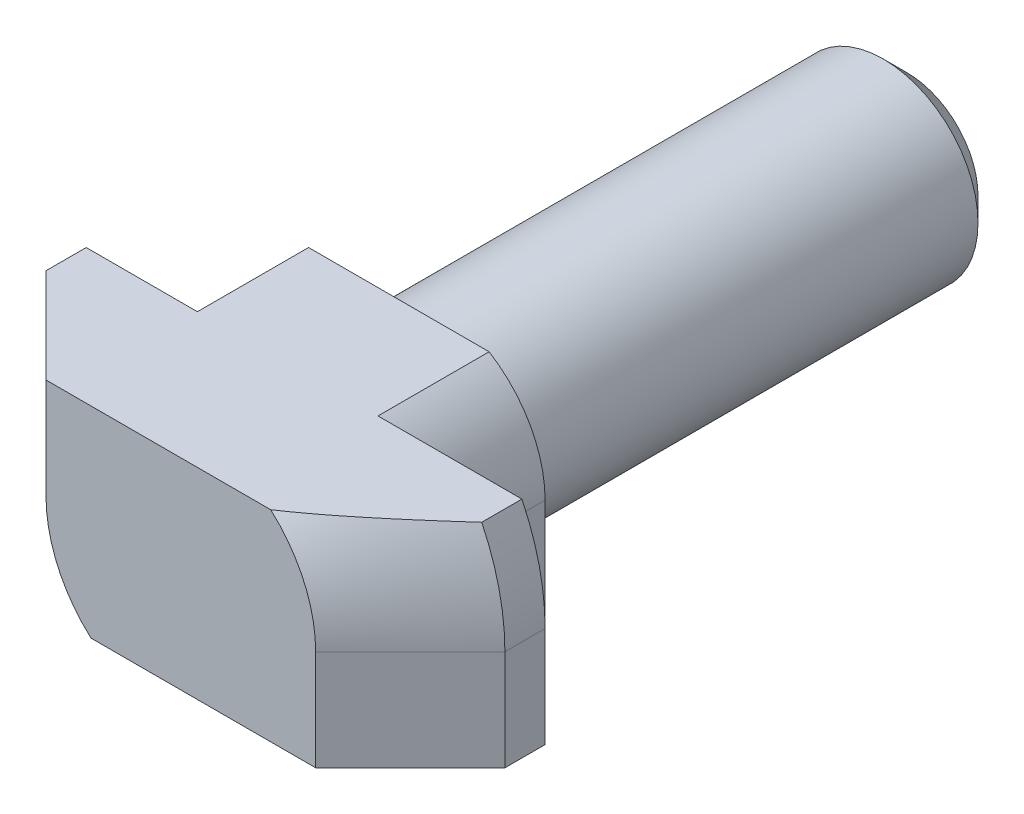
ISO-10303-21;
HEADER;
FILE_DESCRIPTION(('STEP AP214'),'2;1');
FILE_NAME('part.step','',(''),(''),'','','');
FILE_SCHEMA(('AUTOMOTIVE_DESIGN { 1 0 10303 214 1 1 1 1 }'));
ENDSEC;
DATA;
#1=APPLICATION_CONTEXT('core data for automotive mechanical design processes');
#2=APPLICATION_PROTOCOL_DEFINITION('international standard','automotive_design',2000,#1);
#3=PRODUCT_CONTEXT('',#1,'mechanical');
#4=PRODUCT('Part','Part','',(#3));
#5=PRODUCT_RELATED_PRODUCT_CATEGORY('part','',(#4));
#6=PRODUCT_DEFINITION_FORMATION('','',#4);
#7=PRODUCT_DEFINITION_CONTEXT('part definition',#1,'design');
#8=PRODUCT_DEFINITION('design','',#6,#7);
#9=PRODUCT_DEFINITION_SHAPE('','',#8);
#10=(LENGTH_UNIT() NAMED_UNIT(*) SI_UNIT(.MILLI.,.METRE.));
#11=(NAMED_UNIT(*) PLANE_ANGLE_UNIT() SI_UNIT($,.RADIAN.));
#12=(NAMED_UNIT(*) SI_UNIT($,.STERADIAN.) SOLID_ANGLE_UNIT());
#13=UNCERTAINTY_MEASURE_WITH_UNIT(LENGTH_MEASURE(1.E-05),#10,'distance_accuracy_value','');
#14=(GEOMETRIC_REPRESENTATION_CONTEXT(3) GLOBAL_UNCERTAINTY_ASSIGNED_CONTEXT((#13)) GLOBAL_UNIT_ASSIGNED_CONTEXT((#10,
#11,#12)) REPRESENTATION_CONTEXT('',''));
#15=CARTESIAN_POINT('',(0.,0.,0.));
#16=DIRECTION('',(0.,0.,1.));
#17=DIRECTION('',(1.,0.,0.));
#18=AXIS2_PLACEMENT_3D('',#15,#16,#17);
#19=CARTESIAN_POINT('',(9.7,-4.24999999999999,1.7));
#20=DIRECTION('',(1.,0.,0.));
#21=DIRECTION('',(0.,0.,-1.));
#22=AXIS2_PLACEMENT_3D('',#19,#20,#21);
#23=PLANE('',#22);
#24=DIRECTION('',(0.,0.,1.));
#25=VECTOR('',#24,1.);
#26=CARTESIAN_POINT('',(9.7,0.,-3.96));
#27=LINE('',#26,#25);
#28=CARTESIAN_POINT('',(9.7,0.,1.70000000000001));
#29=VERTEX_POINT('',#28);
#30=CARTESIAN_POINT('',(9.7,0.,0.));
#31=VERTEX_POINT('',#30);
#32=EDGE_CURVE('E280',#29,#31,#27,.F.);
#33=ORIENTED_EDGE('',*,*,#32,.F.);
#34=DIRECTION('',(0.,1.,0.));
#35=VECTOR('',#34,1.);
#36=CARTESIAN_POINT('',(9.7,-4.24999999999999,1.70000000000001));
#37=LINE('',#36,#35);
#38=CARTESIAN_POINT('',(9.7,-4.25,1.70000000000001));
#39=VERTEX_POINT('',#38);
#40=EDGE_CURVE('E291',#39,#29,#37,.T.);
#41=ORIENTED_EDGE('',*,*,#40,.F.);
#42=DIRECTION('',(0.,0.,-1.));
#43=VECTOR('',#42,1.);
#44=CARTESIAN_POINT('',(9.7,-4.25,1.7));
#45=LINE('',#44,#43);
#46=CARTESIAN_POINT('',(9.7,-4.25,0.));
#47=VERTEX_POINT('',#46);
#48=EDGE_CURVE('E120',#39,#47,#45,.T.);
#49=ORIENTED_EDGE('',*,*,#48,.T.);
#50=DIRECTION('',(0.,1.,0.));
#51=VECTOR('',#50,1.);
#52=CARTESIAN_POINT('',(9.7,-4.25,0.));
#53=LINE('',#52,#51);
#54=EDGE_CURVE('E229',#31,#47,#53,.F.);
#55=ORIENTED_EDGE('',*,*,#54,.F.);
#56=EDGE_LOOP('',(#33,#41,#49,#55));
#57=FACE_BOUND('',#56,.T.);
#58=ADVANCED_FACE('F16',(#57),#23,.T.);
#59=CARTESIAN_POINT('',(0.,0.,-3.96));
#60=DIRECTION('',(0.,0.,1.));
#61=DIRECTION('',(0.,-1.,0.));
#62=AXIS2_PLACEMENT_3D('',#59,#60,#61);
#63=CYLINDRICAL_SURFACE('',#62,9.7);
#64=DIRECTION('',(0.,0.,1.));
#65=VECTOR('',#64,1.);
#66=CARTESIAN_POINT('',(8.71937497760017,4.25,-3.96));
#67=LINE('',#66,#65);
#68=CARTESIAN_POINT('',(8.71937497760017,4.25,0.));
#69=VERTEX_POINT('',#68);
#70=CARTESIAN_POINT('',(8.71937497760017,4.25,1.70000000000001));
#71=VERTEX_POINT('',#70);
#72=EDGE_CURVE('E277',#69,#71,#67,.T.);
#73=ORIENTED_EDGE('',*,*,#72,.T.);
#74=CARTESIAN_POINT('',(0.,0.,1.70000000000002));
#75=DIRECTION('',(0.,0.,-1.));
#76=DIRECTION('',(-1.,0.,0.));
#77=AXIS2_PLACEMENT_3D('',#74,#75,#76);
#78=CIRCLE('',#77,9.7);
#79=EDGE_CURVE('E254',#29,#71,#78,.F.);
#80=ORIENTED_EDGE('',*,*,#79,.F.);
#81=ORIENTED_EDGE('',*,*,#32,.T.);
#82=CARTESIAN_POINT('',(0.,0.,0.));
#83=DIRECTION('',(0.,0.,1.));
#84=DIRECTION('',(0.,-1.,0.));
#85=AXIS2_PLACEMENT_3D('',#82,#83,#84);
#86=CIRCLE('',#85,9.7);
#87=EDGE_CURVE('E214',#69,#31,#86,.F.);
#88=ORIENTED_EDGE('',*,*,#87,.F.);
#89=EDGE_LOOP('',(#73,#80,#81,#88));
#90=FACE_BOUND('',#89,.T.);
#91=ADVANCED_FACE('F406',(#90),#63,.T.);
#92=CARTESIAN_POINT('',(-9.7,-4.25,0.));
#93=DIRECTION('',(-1.,0.,0.));
#94=DIRECTION('',(0.,0.,1.));
#95=AXIS2_PLACEMENT_3D('',#92,#93,#94);
#96=PLANE('',#95);
#97=DIRECTION('',(0.,0.,1.));
#98=VECTOR('',#97,1.);
#99=CARTESIAN_POINT('',(-9.7,0.,-3.96));
#100=LINE('',#99,#98);
#101=CARTESIAN_POINT('',(-9.7,0.,1.70000000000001));
#102=VERTEX_POINT('',#101);
#103=CARTESIAN_POINT('',(-9.7,0.,0.));
#104=VERTEX_POINT('',#103);
#105=EDGE_CURVE('E106',#102,#104,#100,.F.);
#106=ORIENTED_EDGE('',*,*,#105,.F.);
#107=DIRECTION('',(0.,1.,0.));
#108=VECTOR('',#107,1.);
#109=CARTESIAN_POINT('',(-9.7,-4.24999999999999,1.7));
#110=LINE('',#109,#108);
#111=CARTESIAN_POINT('',(-9.7,4.25,1.7));
#112=VERTEX_POINT('',#111);
#113=EDGE_CURVE('E257',#112,#102,#110,.F.);
#114=ORIENTED_EDGE('',*,*,#113,.F.);
#115=DIRECTION('',(0.,0.,1.));
#116=VECTOR('',#115,1.);
#117=CARTESIAN_POINT('',(-9.7,4.25,0.));
#118=LINE('',#117,#116);
#119=CARTESIAN_POINT('',(-9.7,4.25,0.));
#120=VERTEX_POINT('',#119);
#121=EDGE_CURVE('E272',#112,#120,#118,.F.);
#122=ORIENTED_EDGE('',*,*,#121,.T.);
#123=DIRECTION('',(0.,1.,0.));
#124=VECTOR('',#123,1.);
#125=CARTESIAN_POINT('',(-9.7,-4.25,0.));
#126=LINE('',#125,#124);
#127=EDGE_CURVE('E210',#104,#120,#126,.T.);
#128=ORIENTED_EDGE('',*,*,#127,.F.);
#129=EDGE_LOOP('',(#106,#114,#122,#128));
#130=FACE_BOUND('',#129,.T.);
#131=ADVANCED_FACE('F417',(#130),#96,.T.);
#132=CARTESIAN_POINT('',(0.,0.,-3.96));
#133=DIRECTION('',(0.,0.,1.));
#134=DIRECTION('',(0.,-1.,0.));
#135=AXIS2_PLACEMENT_3D('',#132,#133,#134);
#136=CYLINDRICAL_SURFACE('',#135,9.7);
#137=DIRECTION('',(0.,0.,1.));
#138=VECTOR('',#137,1.);
#139=CARTESIAN_POINT('',(-8.71937497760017,-4.25,-3.96));
#140=LINE('',#139,#138);
#141=CARTESIAN_POINT('',(-8.71937497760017,-4.25,0.));
#142=VERTEX_POINT('',#141);
#143=CARTESIAN_POINT('',(-8.71937497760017,-4.25,1.70000000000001));
#144=VERTEX_POINT('',#143);
#145=EDGE_CURVE('E265',#142,#144,#140,.T.);
#146=ORIENTED_EDGE('',*,*,#145,.T.);
#147=CARTESIAN_POINT('',(0.,0.,1.70000000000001));
#148=DIRECTION('',(0.,0.,-1.));
#149=DIRECTION('',(-1.,0.,0.));
#150=AXIS2_PLACEMENT_3D('',#147,#148,#149);
#151=CIRCLE('',#150,9.7);
#152=EDGE_CURVE('E237',#102,#144,#151,.F.);
#153=ORIENTED_EDGE('',*,*,#152,.F.);
#154=ORIENTED_EDGE('',*,*,#105,.T.);
#155=CARTESIAN_POINT('',(0.,0.,0.));
#156=DIRECTION('',(0.,0.,1.));
#157=DIRECTION('',(0.,-1.,0.));
#158=AXIS2_PLACEMENT_3D('',#155,#156,#157);
#159=CIRCLE('',#158,9.7);
#160=EDGE_CURVE('E213',#142,#104,#159,.F.);
#161=ORIENTED_EDGE('',*,*,#160,.F.);
#162=EDGE_LOOP('',(#146,#153,#154,#161));
#163=FACE_BOUND('',#162,.T.);
#164=ADVANCED_FACE('F415',(#163),#136,.T.);
#165=CARTESIAN_POINT('',(-9.7,-4.24999999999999,1.7));
#166=DIRECTION('',(-0.707106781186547,0.,0.707106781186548));
#167=DIRECTION('',(0.707106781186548,0.,0.707106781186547));
#168=AXIS2_PLACEMENT_3D('',#165,#166,#167);
#169=PLANE('',#168);
#170=DIRECTION('',(0.707106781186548,0.,0.707106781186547));
#171=VECTOR('',#170,1.);
#172=CARTESIAN_POINT('',(-9.78485620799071,0.,1.6151437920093));
#173=LINE('',#172,#171);
#174=CARTESIAN_POINT('',(-5.69999999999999,0.,5.70000000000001));
#175=VERTEX_POINT('',#174);
#176=EDGE_CURVE('E97',#175,#102,#173,.F.);
#177=ORIENTED_EDGE('',*,*,#176,.F.);
#178=DIRECTION('',(0.,-1.,0.));
#179=VECTOR('',#178,1.);
#180=CARTESIAN_POINT('',(-5.69999999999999,-4.24999999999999,5.70000000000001));
#181=LINE('',#180,#179);
#182=CARTESIAN_POINT('',(-5.69999999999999,4.25,5.7));
#183=VERTEX_POINT('',#182);
#184=EDGE_CURVE('E234',#183,#175,#181,.T.);
#185=ORIENTED_EDGE('',*,*,#184,.F.);
#186=DIRECTION('',(0.707106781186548,0.,0.707106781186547));
#187=VECTOR('',#186,1.);
#188=CARTESIAN_POINT('',(-9.7,4.25,1.7));
#189=LINE('',#188,#187);
#190=EDGE_CURVE('E205',#112,#183,#189,.T.);
#191=ORIENTED_EDGE('',*,*,#190,.F.);
#192=ORIENTED_EDGE('',*,*,#113,.T.);
#193=EDGE_LOOP('',(#177,#185,#191,#192));
#194=FACE_BOUND('',#193,.T.);
#195=ADVANCED_FACE('F332',(#194),#169,.T.);
#196=CARTESIAN_POINT('',(0.,0.,1.70000000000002));
#197=DIRECTION('',(0.,0.,-1.));
#198=DIRECTION('',(0.,1.,0.));
#199=AXIS2_PLACEMENT_3D('',#196,#197,#198);
#200=CONICAL_SURFACE('',#199,9.7,0.785398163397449);
#201=CARTESIAN_POINT('',(3.79835490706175,4.25,5.7));
#202=CARTESIAN_POINT('',(3.90853282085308,4.25,5.62656375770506));
#203=CARTESIAN_POINT('',(4.01789915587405,4.25,5.55192451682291));
#204=CARTESIAN_POINT('',(4.23517502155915,4.25,5.40057644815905));
#205=CARTESIAN_POINT('',(4.34308470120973,4.25,5.32386783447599));
#206=CARTESIAN_POINT('',(4.55759359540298,4.25,5.16873300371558));
#207=CARTESIAN_POINT('',(4.66419331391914,4.25,5.09030748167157));
#208=CARTESIAN_POINT('',(4.8762757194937,4.25,4.93195604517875));
#209=CARTESIAN_POINT('',(4.98175837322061,4.25,4.85203008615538));
#210=CARTESIAN_POINT('',(5.29649245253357,4.25,4.61050845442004));
#211=CARTESIAN_POINT('',(5.50427136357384,4.25,4.44699300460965));
#212=CARTESIAN_POINT('',(5.91674995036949,4.25,4.11609272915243));
#213=CARTESIAN_POINT('',(6.12144925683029,4.25,3.94870744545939));
#214=CARTESIAN_POINT('',(6.528184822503,4.25,3.6111074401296));
#215=CARTESIAN_POINT('',(6.73022331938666,4.25,3.44089540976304));
#216=CARTESIAN_POINT('',(7.13229884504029,4.25,3.09812304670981));
#217=CARTESIAN_POINT('',(7.3323358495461,4.25,2.92556268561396));
#218=CARTESIAN_POINT('',(7.73098532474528,4.25,2.57837866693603));
#219=CARTESIAN_POINT('',(7.92959604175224,4.25,2.40375299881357));
#220=CARTESIAN_POINT('',(8.32544628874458,4.25,2.05295391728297));
#221=CARTESIAN_POINT('',(8.52268582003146,4.25,1.8767805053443));
#222=CARTESIAN_POINT('',(8.71937497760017,4.25,1.70000000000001));
#223=B_SPLINE_CURVE_WITH_KNOTS('',3,(#201,#202,#203,#204,#205,#206,#207,#208,#209,#210,#211,
#212,#213,#214,#215,#216,#217,#218,#219,#220,#221,#222),.UNSPECIFIED.,.F.,.F.,(4,2,2,2,2,2,2,2,
2,2,4),(0.,0.397206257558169,0.794371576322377,1.19137898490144,1.58839820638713,
2.38154071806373,3.17477759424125,3.96729822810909,4.7598284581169,5.55320687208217,
6.34658453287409),.UNSPECIFIED.);
#224=CARTESIAN_POINT('',(3.79835490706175,4.25,5.7));
#225=VERTEX_POINT('',#224);
#226=EDGE_CURVE('E204',#225,#71,#223,.T.);
#227=ORIENTED_EDGE('',*,*,#226,.F.);
#228=CARTESIAN_POINT('',(0.,0.,5.7));
#229=DIRECTION('',(0.,0.,-1.));
#230=DIRECTION('',(0.,1.,0.));
#231=AXIS2_PLACEMENT_3D('',#228,#229,#230);
#232=CIRCLE('',#231,5.7);
#233=CARTESIAN_POINT('',(5.7,0.,5.7));
#234=VERTEX_POINT('',#233);
#235=EDGE_CURVE('E296',#234,#225,#232,.F.);
#236=ORIENTED_EDGE('',*,*,#235,.F.);
#237=DIRECTION('',(0.707106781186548,0.,-0.707106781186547));
#238=VECTOR('',#237,1.);
#239=CARTESIAN_POINT('',(5.7,0.,5.70000000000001));
#240=LINE('',#239,#238);
#241=EDGE_CURVE('E241',#29,#234,#240,.F.);
#242=ORIENTED_EDGE('',*,*,#241,.F.);
#243=ORIENTED_EDGE('',*,*,#79,.T.);
#244=EDGE_LOOP('',(#227,#236,#242,#243));
#245=FACE_BOUND('',#244,.T.);
#246=ADVANCED_FACE('F326',(#245),#200,.T.);
#247=CARTESIAN_POINT('',(0.,0.,1.70000000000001));
#248=DIRECTION('',(0.,0.,-1.));
#249=DIRECTION('',(0.,1.,0.));
#250=AXIS2_PLACEMENT_3D('',#247,#248,#249);
#251=CONICAL_SURFACE('',#250,9.7,0.785398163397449);
#252=CARTESIAN_POINT('',(-8.71937497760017,-4.25,1.70000000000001));
#253=CARTESIAN_POINT('',(-8.52268582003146,-4.25,1.87678050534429));
#254=CARTESIAN_POINT('',(-8.32544628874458,-4.25,2.05295391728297));
#255=CARTESIAN_POINT('',(-7.92959604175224,-4.25,2.40375299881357));
#256=CARTESIAN_POINT('',(-7.73098532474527,-4.25,2.57837866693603));
#257=CARTESIAN_POINT('',(-7.3323358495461,-4.25,2.92556268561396));
#258=CARTESIAN_POINT('',(-7.13229884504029,-4.25,3.09812304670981));
#259=CARTESIAN_POINT('',(-6.73022331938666,-4.25,3.44089540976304));
#260=CARTESIAN_POINT('',(-6.52818482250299,-4.25,3.6111074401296));
#261=CARTESIAN_POINT('',(-6.12144925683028,-4.25,3.9487074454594));
#262=CARTESIAN_POINT('',(-5.91674995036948,-4.25,4.11609272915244));
#263=CARTESIAN_POINT('',(-5.50427136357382,-4.25,4.44699300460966));
#264=CARTESIAN_POINT('',(-5.29649245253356,-4.25,4.61050845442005));
#265=CARTESIAN_POINT('',(-4.9817583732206,-4.25,4.85203008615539));
#266=CARTESIAN_POINT('',(-4.87627571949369,-4.25,4.93195604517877));
#267=CARTESIAN_POINT('',(-4.66419331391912,-4.25,5.09030748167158));
#268=CARTESIAN_POINT('',(-4.55759359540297,-4.25,5.16873300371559));
#269=CARTESIAN_POINT('',(-4.34308470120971,-4.25,5.32386783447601));
#270=CARTESIAN_POINT('',(-4.23517502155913,-4.25,5.40057644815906));
#271=CARTESIAN_POINT('',(-4.01789915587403,-4.25,5.55192451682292));
#272=CARTESIAN_POINT('',(-3.90853282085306,-4.25,5.62656375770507));
#273=CARTESIAN_POINT('',(-3.79835490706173,-4.25,5.70000000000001));
#274=B_SPLINE_CURVE_WITH_KNOTS('',3,(#252,#253,#254,#255,#256,#257,#258,#259,#260,#261,#262,
#263,#264,#265,#266,#267,#268,#269,#270,#271,#272,#273),.UNSPECIFIED.,.F.,.F.,(4,2,2,2,2,2,2,2,
2,2,4),(0.,0.79337766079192,1.5867560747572,2.37928630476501,3.17180693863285,3.96504381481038,
4.75818632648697,5.15520554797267,5.55221295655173,5.94937827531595,6.34658453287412),.UNSPECIFIED.);
#275=CARTESIAN_POINT('',(-3.79835490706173,-4.25,5.70000000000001));
#276=VERTEX_POINT('',#275);
#277=EDGE_CURVE('E187',#144,#276,#274,.T.);
#278=ORIENTED_EDGE('',*,*,#277,.T.);
#279=CARTESIAN_POINT('',(0.,0.,5.70000000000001));
#280=DIRECTION('',(0.,0.,-1.));
#281=DIRECTION('',(0.,1.,0.));
#282=AXIS2_PLACEMENT_3D('',#279,#280,#281);
#283=CIRCLE('',#282,5.7);
#284=EDGE_CURVE('E19',#175,#276,#283,.F.);
#285=ORIENTED_EDGE('',*,*,#284,.F.);
#286=ORIENTED_EDGE('',*,*,#176,.T.);
#287=ORIENTED_EDGE('',*,*,#152,.T.);
#288=EDGE_LOOP('',(#278,#285,#286,#287));
#289=FACE_BOUND('',#288,.T.);
#290=ADVANCED_FACE('F320',(#289),#251,.T.);
#291=CARTESIAN_POINT('',(-5.7,-4.24999999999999,5.70000000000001));
#292=DIRECTION('',(0.,0.,1.));
#293=DIRECTION('',(0.,-1.,0.));
#294=AXIS2_PLACEMENT_3D('',#291,#292,#293);
#295=PLANE('',#294);
#296=ORIENTED_EDGE('',*,*,#235,.T.);
#297=DIRECTION('',(1.,0.,0.));
#298=VECTOR('',#297,1.);
#299=CARTESIAN_POINT('',(0.,4.25,5.7));
#300=LINE('',#299,#298);
#301=EDGE_CURVE('E201',#183,#225,#300,.T.);
#302=ORIENTED_EDGE('',*,*,#301,.F.);
#303=ORIENTED_EDGE('',*,*,#184,.T.);
#304=ORIENTED_EDGE('',*,*,#284,.T.);
#305=DIRECTION('',(1.,0.,0.));
#306=VECTOR('',#305,1.);
#307=CARTESIAN_POINT('',(0.,-4.25,5.70000000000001));
#308=LINE('',#307,#306);
#309=CARTESIAN_POINT('',(5.7,-4.25,5.70000000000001));
#310=VERTEX_POINT('',#309);
#311=EDGE_CURVE('E132',#276,#310,#308,.T.);
#312=ORIENTED_EDGE('',*,*,#311,.T.);
#313=DIRECTION('',(0.,1.,0.));
#314=VECTOR('',#313,1.);
#315=CARTESIAN_POINT('',(5.70000000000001,-4.24999999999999,5.70000000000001));
#316=LINE('',#315,#314);
#317=EDGE_CURVE('E231',#234,#310,#316,.F.);
#318=ORIENTED_EDGE('',*,*,#317,.F.);
#319=EDGE_LOOP('',(#296,#302,#303,#304,#312,#318));
#320=FACE_BOUND('',#319,.T.);
#321=ADVANCED_FACE('F325',(#320),#295,.T.);
#322=CARTESIAN_POINT('',(5.7,-4.24999999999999,5.70000000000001));
#323=DIRECTION('',(0.707106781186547,0.,0.707106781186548));
#324=DIRECTION('',(0.707106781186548,0.,-0.707106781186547));
#325=AXIS2_PLACEMENT_3D('',#322,#323,#324);
#326=PLANE('',#325);
#327=ORIENTED_EDGE('',*,*,#241,.T.);
#328=ORIENTED_EDGE('',*,*,#317,.T.);
#329=DIRECTION('',(0.707106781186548,0.,-0.707106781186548));
#330=VECTOR('',#329,1.);
#331=CARTESIAN_POINT('',(5.7,-4.25,5.70000000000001));
#332=LINE('',#331,#330);
#333=EDGE_CURVE('E186',#310,#39,#332,.T.);
#334=ORIENTED_EDGE('',*,*,#333,.T.);
#335=ORIENTED_EDGE('',*,*,#40,.T.);
#336=EDGE_LOOP('',(#327,#328,#334,#335));
#337=FACE_BOUND('',#336,.T.);
#338=ADVANCED_FACE('F360',(#337),#326,.T.);
#339=CARTESIAN_POINT('',(9.7,-4.25,0.));
#340=DIRECTION('',(0.,0.,-1.));
#341=DIRECTION('',(0.,1.,0.));
#342=AXIS2_PLACEMENT_3D('',#339,#340,#341);
#343=PLANE('',#342);
#344=DIRECTION('',(1.,0.,0.));
#345=VECTOR('',#344,1.);
#346=CARTESIAN_POINT('',(0.,4.25,0.));
#347=LINE('',#346,#345);
#348=CARTESIAN_POINT('',(2.63391343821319,4.25,0.));
#349=VERTEX_POINT('',#348);
#350=EDGE_CURVE('E252',#69,#349,#347,.F.);
#351=ORIENTED_EDGE('',*,*,#350,.F.);
#352=ORIENTED_EDGE('',*,*,#87,.T.);
#353=ORIENTED_EDGE('',*,*,#54,.T.);
#354=DIRECTION('',(1.,0.,0.));
#355=VECTOR('',#354,1.);
#356=CARTESIAN_POINT('',(0.,-4.25,0.));
#357=LINE('',#356,#355);
#358=CARTESIAN_POINT('',(5.,-4.25,0.));
#359=VERTEX_POINT('',#358);
#360=EDGE_CURVE('E192',#47,#359,#357,.F.);
#361=ORIENTED_EDGE('',*,*,#360,.T.);
#362=DIRECTION('',(0.,1.,0.));
#363=VECTOR('',#362,1.);
#364=CARTESIAN_POINT('',(5.,-4.25,0.));
#365=LINE('',#364,#363);
#366=CARTESIAN_POINT('',(5.,0.,0.));
#367=VERTEX_POINT('',#366);
#368=EDGE_CURVE('E198',#367,#359,#365,.F.);
#369=ORIENTED_EDGE('',*,*,#368,.F.);
#370=CARTESIAN_POINT('',(0.,0.,0.));
#371=DIRECTION('',(0.,0.,1.));
#372=DIRECTION('',(0.,-1.,0.));
#373=AXIS2_PLACEMENT_3D('',#370,#371,#372);
#374=CIRCLE('',#373,5.);
#375=EDGE_CURVE('E200',#349,#367,#374,.F.);
#376=ORIENTED_EDGE('',*,*,#375,.F.);
#377=EDGE_LOOP('',(#351,#352,#353,#361,#369,#376));
#378=FACE_BOUND('',#377,.T.);
#379=ADVANCED_FACE('F357',(#378),#343,.T.);
#380=CARTESIAN_POINT('',(-5.,-4.25,0.));
#381=DIRECTION('',(0.,0.,-1.));
#382=DIRECTION('',(0.,1.,0.));
#383=AXIS2_PLACEMENT_3D('',#380,#381,#382);
#384=PLANE('',#383);
#385=DIRECTION('',(1.,0.,0.));
#386=VECTOR('',#385,1.);
#387=CARTESIAN_POINT('',(0.,-4.25,0.));
#388=LINE('',#387,#386);
#389=CARTESIAN_POINT('',(-2.63391343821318,-4.25,0.));
#390=VERTEX_POINT('',#389);
#391=EDGE_CURVE('E183',#390,#142,#388,.F.);
#392=ORIENTED_EDGE('',*,*,#391,.T.);
#393=ORIENTED_EDGE('',*,*,#160,.T.);
#394=ORIENTED_EDGE('',*,*,#127,.T.);
#395=DIRECTION('',(1.,0.,0.));
#396=VECTOR('',#395,1.);
#397=CARTESIAN_POINT('',(0.,4.25,0.));
#398=LINE('',#397,#396);
#399=CARTESIAN_POINT('',(-5.,4.25,0.));
#400=VERTEX_POINT('',#399);
#401=EDGE_CURVE('E152',#400,#120,#398,.F.);
#402=ORIENTED_EDGE('',*,*,#401,.F.);
#403=DIRECTION('',(0.,1.,0.));
#404=VECTOR('',#403,1.);
#405=CARTESIAN_POINT('',(-5.,-4.25,0.));
#406=LINE('',#405,#404);
#407=CARTESIAN_POINT('',(-5.,0.,0.));
#408=VERTEX_POINT('',#407);
#409=EDGE_CURVE('E148',#408,#400,#406,.T.);
#410=ORIENTED_EDGE('',*,*,#409,.F.);
#411=CARTESIAN_POINT('',(0.,0.,0.));
#412=DIRECTION('',(0.,0.,1.));
#413=DIRECTION('',(0.,-1.,0.));
#414=AXIS2_PLACEMENT_3D('',#411,#412,#413);
#415=CIRCLE('',#414,5.);
#416=EDGE_CURVE('E172',#390,#408,#415,.F.);
#417=ORIENTED_EDGE('',*,*,#416,.F.);
#418=EDGE_LOOP('',(#392,#393,#394,#402,#410,#417));
#419=FACE_BOUND('',#418,.T.);
#420=ADVANCED_FACE('F353',(#419),#384,.T.);
#421=CARTESIAN_POINT('',(0.,0.,-25.));
#422=DIRECTION('',(0.,0.,1.));
#423=DIRECTION('',(1.,0.,0.));
#424=AXIS2_PLACEMENT_3D('',#421,#422,#423);
#425=PLANE('',#424);
#426=CARTESIAN_POINT('',(0.,0.,-24.9999999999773));
#427=DIRECTION('',(0.,0.,1.));
#428=DIRECTION('',(1.,0.,0.));
#429=AXIS2_PLACEMENT_3D('',#426,#427,#428);
#430=CIRCLE('',#429,2.9999999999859);
#431=CARTESIAN_POINT('',(2.9999999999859,0.,-24.9999999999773));
#432=VERTEX_POINT('',#431);
#433=EDGE_CURVE('E169',#432,#432,#430,.T.);
#434=ORIENTED_EDGE('',*,*,#433,.F.);
#435=EDGE_LOOP('',(#434));
#436=FACE_BOUND('',#435,.T.);
#437=ADVANCED_FACE('F350',(#436),#425,.F.);
#438=CARTESIAN_POINT('',(-5.,-4.25,-3.49999999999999));
#439=DIRECTION('',(-1.,0.,0.));
#440=DIRECTION('',(0.,0.,1.));
#441=AXIS2_PLACEMENT_3D('',#438,#439,#440);
#442=PLANE('',#441);
#443=DIRECTION('',(0.,0.,1.));
#444=VECTOR('',#443,1.);
#445=CARTESIAN_POINT('',(-5.,0.,-3.96));
#446=LINE('',#445,#444);
#447=CARTESIAN_POINT('',(-5.,0.,-4.7));
#448=VERTEX_POINT('',#447);
#449=EDGE_CURVE('E181',#408,#448,#446,.F.);
#450=ORIENTED_EDGE('',*,*,#449,.F.);
#451=ORIENTED_EDGE('',*,*,#409,.T.);
#452=DIRECTION('',(0.,0.,1.));
#453=VECTOR('',#452,1.);
#454=CARTESIAN_POINT('',(-5.,4.25,0.));
#455=LINE('',#454,#453);
#456=CARTESIAN_POINT('',(-5.,4.25,-4.70000000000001));
#457=VERTEX_POINT('',#456);
#458=EDGE_CURVE('E141',#457,#400,#455,.T.);
#459=ORIENTED_EDGE('',*,*,#458,.F.);
#460=DIRECTION('',(0.,1.,0.));
#461=VECTOR('',#460,1.);
#462=CARTESIAN_POINT('',(-5.,-4.25,-4.7));
#463=LINE('',#462,#461);
#464=EDGE_CURVE('E146',#448,#457,#463,.T.);
#465=ORIENTED_EDGE('',*,*,#464,.F.);
#466=EDGE_LOOP('',(#450,#451,#459,#465));
#467=FACE_BOUND('',#466,.T.);
#468=ADVANCED_FACE('F144',(#467),#442,.T.);
#469=CARTESIAN_POINT('',(0.,4.25,0.));
#470=DIRECTION('',(0.,1.,0.));
#471=DIRECTION('',(0.,0.,1.));
#472=AXIS2_PLACEMENT_3D('',#469,#470,#471);
#473=PLANE('',#472);
#474=ORIENTED_EDGE('',*,*,#350,.T.);
#475=DIRECTION('',(0.,0.,1.));
#476=VECTOR('',#475,1.);
#477=CARTESIAN_POINT('',(2.63391343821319,4.25,-3.96));
#478=LINE('',#477,#476);
#479=CARTESIAN_POINT('',(2.63391343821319,4.25,-4.7));
#480=VERTEX_POINT('',#479);
#481=EDGE_CURVE('E159',#480,#349,#478,.T.);
#482=ORIENTED_EDGE('',*,*,#481,.F.);
#483=DIRECTION('',(1.,0.,0.));
#484=VECTOR('',#483,1.);
#485=CARTESIAN_POINT('',(-4.25,4.25,-4.70000000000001));
#486=LINE('',#485,#484);
#487=EDGE_CURVE('E155',#457,#480,#486,.T.);
#488=ORIENTED_EDGE('',*,*,#487,.F.);
#489=ORIENTED_EDGE('',*,*,#458,.T.);
#490=ORIENTED_EDGE('',*,*,#401,.T.);
#491=ORIENTED_EDGE('',*,*,#121,.F.);
#492=ORIENTED_EDGE('',*,*,#190,.T.);
#493=ORIENTED_EDGE('',*,*,#301,.T.);
#494=ORIENTED_EDGE('',*,*,#226,.T.);
#495=ORIENTED_EDGE('',*,*,#72,.F.);
#496=EDGE_LOOP('',(#474,#482,#488,#489,#490,#491,#492,#493,#494,#495));
#497=FACE_BOUND('',#496,.T.);
#498=ADVANCED_FACE('F157',(#497),#473,.T.);
#499=CARTESIAN_POINT('',(0.,0.,-3.96));
#500=DIRECTION('',(0.,0.,1.));
#501=DIRECTION('',(0.,-1.,0.));
#502=AXIS2_PLACEMENT_3D('',#499,#500,#501);
#503=CYLINDRICAL_SURFACE('',#502,5.);
#504=CARTESIAN_POINT('',(0.,0.,-4.7));
#505=DIRECTION('',(0.,0.,1.));
#506=DIRECTION('',(0.,-1.,0.));
#507=AXIS2_PLACEMENT_3D('',#504,#505,#506);
#508=CIRCLE('',#507,5.);
#509=CARTESIAN_POINT('',(5.,0.,-4.7));
#510=VERTEX_POINT('',#509);
#511=EDGE_CURVE('E163',#480,#510,#508,.F.);
#512=ORIENTED_EDGE('',*,*,#511,.F.);
#513=ORIENTED_EDGE('',*,*,#481,.T.);
#514=ORIENTED_EDGE('',*,*,#375,.T.);
#515=DIRECTION('',(0.,0.,-1.));
#516=VECTOR('',#515,1.);
#517=CARTESIAN_POINT('',(5.,0.,0.));
#518=LINE('',#517,#516);
#519=EDGE_CURVE('E195',#510,#367,#518,.F.);
#520=ORIENTED_EDGE('',*,*,#519,.F.);
#521=EDGE_LOOP('',(#512,#513,#514,#520));
#522=FACE_BOUND('',#521,.T.);
#523=ADVANCED_FACE('F347',(#522),#503,.T.);
#524=CARTESIAN_POINT('',(5.,-4.25,0.));
#525=DIRECTION('',(1.,0.,0.));
#526=DIRECTION('',(0.,0.,-1.));
#527=AXIS2_PLACEMENT_3D('',#524,#525,#526);
#528=PLANE('',#527);
#529=ORIENTED_EDGE('',*,*,#519,.T.);
#530=ORIENTED_EDGE('',*,*,#368,.T.);
#531=DIRECTION('',(0.,0.,1.));
#532=VECTOR('',#531,1.);
#533=CARTESIAN_POINT('',(5.,-4.25,0.));
#534=LINE('',#533,#532);
#535=CARTESIAN_POINT('',(5.,-4.25,-4.7));
#536=VERTEX_POINT('',#535);
#537=EDGE_CURVE('E190',#359,#536,#534,.F.);
#538=ORIENTED_EDGE('',*,*,#537,.T.);
#539=DIRECTION('',(0.,1.,0.));
#540=VECTOR('',#539,1.);
#541=CARTESIAN_POINT('',(5.,-4.25,-4.7));
#542=LINE('',#541,#540);
#543=EDGE_CURVE('E304',#510,#536,#542,.F.);
#544=ORIENTED_EDGE('',*,*,#543,.F.);
#545=EDGE_LOOP('',(#529,#530,#538,#544));
#546=FACE_BOUND('',#545,.T.);
#547=ADVANCED_FACE('F388',(#546),#528,.T.);
#548=CARTESIAN_POINT('',(0.,-4.25,0.));
#549=DIRECTION('',(0.,1.,0.));
#550=DIRECTION('',(0.,0.,1.));
#551=AXIS2_PLACEMENT_3D('',#548,#549,#550);
#552=PLANE('',#551);
#553=DIRECTION('',(0.,0.,1.));
#554=VECTOR('',#553,1.);
#555=CARTESIAN_POINT('',(-2.63391343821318,-4.25,-3.96));
#556=LINE('',#555,#554);
#557=CARTESIAN_POINT('',(-2.63391343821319,-4.25,-4.7));
#558=VERTEX_POINT('',#557);
#559=EDGE_CURVE('E34',#558,#390,#556,.T.);
#560=ORIENTED_EDGE('',*,*,#559,.F.);
#561=DIRECTION('',(1.,0.,0.));
#562=VECTOR('',#561,1.);
#563=CARTESIAN_POINT('',(-4.25,-4.25,-4.7));
#564=LINE('',#563,#562);
#565=EDGE_CURVE('E303',#536,#558,#564,.F.);
#566=ORIENTED_EDGE('',*,*,#565,.F.);
#567=ORIENTED_EDGE('',*,*,#537,.F.);
#568=ORIENTED_EDGE('',*,*,#360,.F.);
#569=ORIENTED_EDGE('',*,*,#48,.F.);
#570=ORIENTED_EDGE('',*,*,#333,.F.);
#571=ORIENTED_EDGE('',*,*,#311,.F.);
#572=ORIENTED_EDGE('',*,*,#277,.F.);
#573=ORIENTED_EDGE('',*,*,#145,.F.);
#574=ORIENTED_EDGE('',*,*,#391,.F.);
#575=EDGE_LOOP('',(#560,#566,#567,#568,#569,#570,#571,#572,#573,#574));
#576=FACE_BOUND('',#575,.T.);
#577=ADVANCED_FACE('F316',(#576),#552,.F.);
#578=CARTESIAN_POINT('',(0.,0.,-3.96));
#579=DIRECTION('',(0.,0.,1.));
#580=DIRECTION('',(0.,-1.,0.));
#581=AXIS2_PLACEMENT_3D('',#578,#579,#580);
#582=CYLINDRICAL_SURFACE('',#581,5.);
#583=ORIENTED_EDGE('',*,*,#559,.T.);
#584=ORIENTED_EDGE('',*,*,#416,.T.);
#585=ORIENTED_EDGE('',*,*,#449,.T.);
#586=CARTESIAN_POINT('',(0.,0.,-4.7));
#587=DIRECTION('',(0.,0.,1.));
#588=DIRECTION('',(0.,-1.,0.));
#589=AXIS2_PLACEMENT_3D('',#586,#587,#588);
#590=CIRCLE('',#589,5.);
#591=EDGE_CURVE('E168',#558,#448,#590,.F.);
#592=ORIENTED_EDGE('',*,*,#591,.F.);
#593=EDGE_LOOP('',(#583,#584,#585,#592));
#594=FACE_BOUND('',#593,.T.);
#595=ADVANCED_FACE('F381',(#594),#582,.T.);
#596=CARTESIAN_POINT('',(0.,0.,-24.0000000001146));
#597=DIRECTION('',(0.,0.,1.));
#598=DIRECTION('',(1.,0.,0.));
#599=AXIS2_PLACEMENT_3D('',#596,#597,#598);
#600=CONICAL_SURFACE('',#599,3.99999999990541,0.78539816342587);
#601=CARTESIAN_POINT('',(0.,0.,-24.));
#602=DIRECTION('',(0.,0.,-1.));
#603=DIRECTION('',(-1.,0.,0.));
#604=AXIS2_PLACEMENT_3D('',#601,#602,#603);
#605=CIRCLE('',#604,4.);
#606=CARTESIAN_POINT('',(-4.,0.,-24.));
#607=VERTEX_POINT('',#606);
#608=EDGE_CURVE('E25',#607,#607,#605,.F.);
#609=ORIENTED_EDGE('',*,*,#608,.F.);
#610=EDGE_LOOP('',(#609));
#611=FACE_BOUND('',#610,.T.);
#612=ORIENTED_EDGE('',*,*,#433,.T.);
#613=EDGE_LOOP('',(#612));
#614=FACE_BOUND('',#613,.T.);
#615=ADVANCED_FACE('F375',(#611,#614),#600,.T.);
#616=CARTESIAN_POINT('',(-4.25,-4.25,-4.7));
#617=DIRECTION('',(0.,0.,-1.));
#618=DIRECTION('',(0.,1.,0.));
#619=AXIS2_PLACEMENT_3D('',#616,#617,#618);
#620=PLANE('',#619);
#621=CARTESIAN_POINT('',(0.,0.,-4.7));
#622=DIRECTION('',(0.,0.,-1.));
#623=DIRECTION('',(-1.,0.,0.));
#624=AXIS2_PLACEMENT_3D('',#621,#622,#623);
#625=CIRCLE('',#624,4.);
#626=CARTESIAN_POINT('',(-4.,0.,-4.7));
#627=VERTEX_POINT('',#626);
#628=EDGE_CURVE('E10',#627,#627,#625,.T.);
#629=ORIENTED_EDGE('',*,*,#628,.F.);
#630=EDGE_LOOP('',(#629));
#631=FACE_BOUND('',#630,.T.);
#632=ORIENTED_EDGE('',*,*,#565,.T.);
#633=ORIENTED_EDGE('',*,*,#591,.T.);
#634=ORIENTED_EDGE('',*,*,#464,.T.);
#635=ORIENTED_EDGE('',*,*,#487,.T.);
#636=ORIENTED_EDGE('',*,*,#511,.T.);
#637=ORIENTED_EDGE('',*,*,#543,.T.);
#638=EDGE_LOOP('',(#632,#633,#634,#635,#636,#637));
#639=FACE_BOUND('',#638,.T.);
#640=ADVANCED_FACE('F167',(#631,#639),#620,.T.);
#641=CARTESIAN_POINT('',(0.,0.,-3.5));
#642=DIRECTION('',(0.,0.,-1.));
#643=DIRECTION('',(-1.,0.,0.));
#644=AXIS2_PLACEMENT_3D('',#641,#642,#643);
#645=CYLINDRICAL_SURFACE('',#644,4.);
#646=ORIENTED_EDGE('',*,*,#608,.T.);
#647=EDGE_LOOP('',(#646));
#648=FACE_BOUND('',#647,.T.);
#649=ORIENTED_EDGE('',*,*,#628,.T.);
#650=EDGE_LOOP('',(#649));
#651=FACE_BOUND('',#650,.T.);
#652=ADVANCED_FACE('F368',(#648,#651),#645,.T.);
#653=CLOSED_SHELL('',(#58,#91,#131,#164,#195,#246,#290,#321,#338,#379,#420,#437,#468,#498,#523,
#547,#577,#595,#615,#640,#652));
#654=MANIFOLD_SOLID_BREP('B1',#653);
#655=ADVANCED_BREP_SHAPE_REPRESENTATION('',(#18,#654),#14);
#656=SHAPE_DEFINITION_REPRESENTATION(#9,#655);
ENDSEC;
END-ISO-10303-21;
